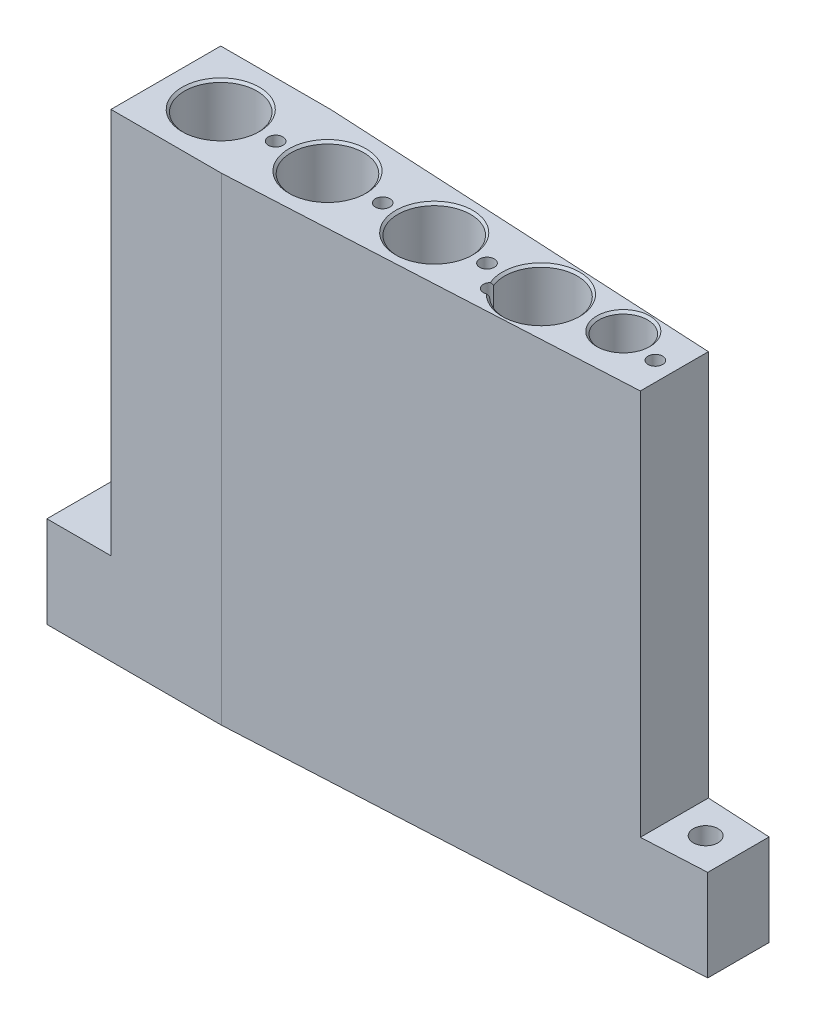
ISO-10303-21;
HEADER;
FILE_DESCRIPTION(('STEP AP214'),'2;1');
FILE_NAME('part.step','',(''),(''),'','','');
FILE_SCHEMA(('AUTOMOTIVE_DESIGN { 1 0 10303 214 1 1 1 1 }'));
ENDSEC;
DATA;
#1=APPLICATION_CONTEXT('core data for automotive mechanical design processes');
#2=APPLICATION_PROTOCOL_DEFINITION('international standard','automotive_design',2000,#1);
#3=PRODUCT_CONTEXT('',#1,'mechanical');
#4=PRODUCT('Part','Part','',(#3));
#5=PRODUCT_RELATED_PRODUCT_CATEGORY('part','',(#4));
#6=PRODUCT_DEFINITION_FORMATION('','',#4);
#7=PRODUCT_DEFINITION_CONTEXT('part definition',#1,'design');
#8=PRODUCT_DEFINITION('design','',#6,#7);
#9=PRODUCT_DEFINITION_SHAPE('','',#8);
#10=(LENGTH_UNIT() NAMED_UNIT(*) SI_UNIT(.MILLI.,.METRE.));
#11=(NAMED_UNIT(*) PLANE_ANGLE_UNIT() SI_UNIT($,.RADIAN.));
#12=(NAMED_UNIT(*) SI_UNIT($,.STERADIAN.) SOLID_ANGLE_UNIT());
#13=UNCERTAINTY_MEASURE_WITH_UNIT(LENGTH_MEASURE(1.E-05),#10,'distance_accuracy_value','');
#14=(GEOMETRIC_REPRESENTATION_CONTEXT(3) GLOBAL_UNCERTAINTY_ASSIGNED_CONTEXT((#13)) GLOBAL_UNIT_ASSIGNED_CONTEXT((#10,
#11,#12)) REPRESENTATION_CONTEXT('',''));
#15=CARTESIAN_POINT('',(0.,0.,0.));
#16=DIRECTION('',(0.,0.,1.));
#17=DIRECTION('',(1.,0.,0.));
#18=AXIS2_PLACEMENT_3D('',#15,#16,#17);
#19=CARTESIAN_POINT('',(69.58,52.25,-3.3534667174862));
#20=DIRECTION('',(-0.0523359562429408,0.,0.998629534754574));
#21=DIRECTION('',(0.998629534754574,0.,0.0523359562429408));
#22=AXIS2_PLACEMENT_3D('',#19,#20,#21);
#23=PLANE('',#22);
#24=DIRECTION('',(-0.998629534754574,0.,-0.0523359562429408));
#25=VECTOR('',#24,1.);
#26=CARTESIAN_POINT('',(69.58,0.,-3.3534667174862));
#27=LINE('',#26,#25);
#28=CARTESIAN_POINT('',(69.58,0.,-3.3534667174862));
#29=VERTEX_POINT('',#28);
#30=CARTESIAN_POINT('',(19.0811366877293,0.,-6.));
#31=VERTEX_POINT('',#30);
#32=EDGE_CURVE('E373',#29,#31,#27,.T.);
#33=ORIENTED_EDGE('',*,*,#32,.T.);
#34=DIRECTION('',(0.,-1.,0.));
#35=VECTOR('',#34,1.);
#36=CARTESIAN_POINT('',(19.0811366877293,52.25,-6.));
#37=LINE('',#36,#35);
#38=CARTESIAN_POINT('',(19.0811366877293,52.25,-6.));
#39=VERTEX_POINT('',#38);
#40=EDGE_CURVE('E343',#39,#31,#37,.T.);
#41=ORIENTED_EDGE('',*,*,#40,.F.);
#42=DIRECTION('',(-0.998629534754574,0.,-0.0523359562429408));
#43=VECTOR('',#42,1.);
#44=CARTESIAN_POINT('',(69.58,52.25,-3.3534667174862));
#45=LINE('',#44,#43);
#46=CARTESIAN_POINT('',(62.58,52.25,-3.72032117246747));
#47=VERTEX_POINT('',#46);
#48=EDGE_CURVE('E364',#47,#39,#45,.T.);
#49=ORIENTED_EDGE('',*,*,#48,.F.);
#50=DIRECTION('',(0.,1.,0.));
#51=VECTOR('',#50,1.);
#52=CARTESIAN_POINT('',(62.58,9.99999999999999,-3.72032117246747));
#53=LINE('',#52,#51);
#54=CARTESIAN_POINT('',(62.58,9.99999999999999,-3.72032117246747));
#55=VERTEX_POINT('',#54);
#56=EDGE_CURVE('E644',#55,#47,#53,.T.);
#57=ORIENTED_EDGE('',*,*,#56,.F.);
#58=DIRECTION('',(-0.998629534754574,0.,-0.0523359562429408));
#59=VECTOR('',#58,1.);
#60=CARTESIAN_POINT('',(69.58,9.99999999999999,-3.3534667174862));
#61=LINE('',#60,#59);
#62=CARTESIAN_POINT('',(69.58,9.99999999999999,-3.3534667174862));
#63=VERTEX_POINT('',#62);
#64=EDGE_CURVE('E650',#63,#55,#61,.T.);
#65=ORIENTED_EDGE('',*,*,#64,.F.);
#66=DIRECTION('',(0.,-1.,0.));
#67=VECTOR('',#66,1.);
#68=CARTESIAN_POINT('',(69.58,52.25,-3.3534667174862));
#69=LINE('',#68,#67);
#70=EDGE_CURVE('E363',#63,#29,#69,.T.);
#71=ORIENTED_EDGE('',*,*,#70,.T.);
#72=EDGE_LOOP('',(#33,#41,#49,#57,#65,#71));
#73=FACE_BOUND('',#72,.T.);
#74=ADVANCED_FACE('F221',(#73),#23,.F.);
#75=CARTESIAN_POINT('',(0.,52.25,7.));
#76=DIRECTION('',(-0.0523359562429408,0.,-0.998629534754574));
#77=DIRECTION('',(-0.998629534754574,0.,0.0523359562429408));
#78=AXIS2_PLACEMENT_3D('',#75,#76,#77);
#79=PLANE('',#78);
#80=DIRECTION('',(0.998629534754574,0.,-0.0523359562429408));
#81=VECTOR('',#80,1.);
#82=CARTESIAN_POINT('',(0.,52.25,7.));
#83=LINE('',#82,#81);
#84=CARTESIAN_POINT('',(19.0811366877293,52.25,6.));
#85=VERTEX_POINT('',#84);
#86=CARTESIAN_POINT('',(62.58,52.25,3.72032117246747));
#87=VERTEX_POINT('',#86);
#88=EDGE_CURVE('E350',#85,#87,#83,.T.);
#89=ORIENTED_EDGE('',*,*,#88,.F.);
#90=DIRECTION('',(0.,-1.,0.));
#91=VECTOR('',#90,1.);
#92=CARTESIAN_POINT('',(19.0811366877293,52.25,6.));
#93=LINE('',#92,#91);
#94=CARTESIAN_POINT('',(19.0811366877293,0.,6.));
#95=VERTEX_POINT('',#94);
#96=EDGE_CURVE('E332',#85,#95,#93,.T.);
#97=ORIENTED_EDGE('',*,*,#96,.T.);
#98=DIRECTION('',(0.998629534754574,0.,-0.0523359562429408));
#99=VECTOR('',#98,1.);
#100=CARTESIAN_POINT('',(0.,0.,7.));
#101=LINE('',#100,#99);
#102=CARTESIAN_POINT('',(69.58,0.,3.3534667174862));
#103=VERTEX_POINT('',#102);
#104=EDGE_CURVE('E380',#95,#103,#101,.T.);
#105=ORIENTED_EDGE('',*,*,#104,.T.);
#106=DIRECTION('',(0.,-1.,0.));
#107=VECTOR('',#106,1.);
#108=CARTESIAN_POINT('',(69.58,52.25,3.3534667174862));
#109=LINE('',#108,#107);
#110=CARTESIAN_POINT('',(69.58,9.99999999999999,3.3534667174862));
#111=VERTEX_POINT('',#110);
#112=EDGE_CURVE('E366',#111,#103,#109,.T.);
#113=ORIENTED_EDGE('',*,*,#112,.F.);
#114=DIRECTION('',(0.998629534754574,0.,-0.0523359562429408));
#115=VECTOR('',#114,1.);
#116=CARTESIAN_POINT('',(0.,9.99999999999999,7.));
#117=LINE('',#116,#115);
#118=CARTESIAN_POINT('',(62.58,9.99999999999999,3.72032117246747));
#119=VERTEX_POINT('',#118);
#120=EDGE_CURVE('E648',#119,#111,#117,.T.);
#121=ORIENTED_EDGE('',*,*,#120,.F.);
#122=DIRECTION('',(0.,1.,0.));
#123=VECTOR('',#122,1.);
#124=CARTESIAN_POINT('',(62.58,9.99999999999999,3.72032117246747));
#125=LINE('',#124,#123);
#126=EDGE_CURVE('E362',#119,#87,#125,.T.);
#127=ORIENTED_EDGE('',*,*,#126,.T.);
#128=EDGE_LOOP('',(#89,#97,#105,#113,#121,#127));
#129=FACE_BOUND('',#128,.T.);
#130=ADVANCED_FACE('F359',(#129),#79,.F.);
#131=CARTESIAN_POINT('',(0.,52.25,-7.));
#132=DIRECTION('',(0.,1.,0.));
#133=DIRECTION('',(0.,0.,1.));
#134=AXIS2_PLACEMENT_3D('',#131,#132,#133);
#135=PLANE('',#134);
#136=CARTESIAN_POINT('',(56.,52.25,-1.));
#137=DIRECTION('',(0.,1.,0.));
#138=DIRECTION('',(0.,0.,1.));
#139=AXIS2_PLACEMENT_3D('',#136,#137,#138);
#140=CIRCLE('',#139,2.90429999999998);
#141=CARTESIAN_POINT('',(56.,52.25,1.90429999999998));
#142=VERTEX_POINT('',#141);
#143=EDGE_CURVE('E597',#142,#142,#140,.F.);
#144=ORIENTED_EDGE('',*,*,#143,.T.);
#145=EDGE_LOOP('',(#144));
#146=FACE_BOUND('',#145,.T.);
#147=CARTESIAN_POINT('',(36.3333333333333,52.25,0.));
#148=DIRECTION('',(0.,1.,0.));
#149=DIRECTION('',(0.,0.,1.));
#150=AXIS2_PLACEMENT_3D('',#147,#148,#149);
#151=CIRCLE('',#150,4.21874999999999);
#152=CARTESIAN_POINT('',(36.3333333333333,52.25,4.21874999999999));
#153=VERTEX_POINT('',#152);
#154=EDGE_CURVE('E592',#153,#153,#151,.F.);
#155=ORIENTED_EDGE('',*,*,#154,.T.);
#156=EDGE_LOOP('',(#155));
#157=FACE_BOUND('',#156,.T.);
#158=CARTESIAN_POINT('',(24.6666666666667,52.25,0.));
#159=DIRECTION('',(0.,1.,0.));
#160=DIRECTION('',(0.,0.,1.));
#161=AXIS2_PLACEMENT_3D('',#158,#159,#160);
#162=CIRCLE('',#161,4.21874999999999);
#163=CARTESIAN_POINT('',(24.6666666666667,52.25,4.21874999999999));
#164=VERTEX_POINT('',#163);
#165=EDGE_CURVE('E589',#164,#164,#162,.F.);
#166=ORIENTED_EDGE('',*,*,#165,.T.);
#167=EDGE_LOOP('',(#166));
#168=FACE_BOUND('',#167,.T.);
#169=CARTESIAN_POINT('',(13.,52.25,0.));
#170=DIRECTION('',(0.,1.,0.));
#171=DIRECTION('',(0.,0.,1.));
#172=AXIS2_PLACEMENT_3D('',#169,#170,#171);
#173=CIRCLE('',#172,4.21874999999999);
#174=CARTESIAN_POINT('',(13.,52.25,4.21874999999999));
#175=VERTEX_POINT('',#174);
#176=EDGE_CURVE('E586',#175,#175,#173,.F.);
#177=ORIENTED_EDGE('',*,*,#176,.T.);
#178=EDGE_LOOP('',(#177));
#179=FACE_BOUND('',#178,.T.);
#180=DIRECTION('',(1.,0.,0.));
#181=VECTOR('',#180,1.);
#182=CARTESIAN_POINT('',(19.0811366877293,52.25,6.));
#183=LINE('',#182,#181);
#184=CARTESIAN_POINT('',(7.,52.25,6.));
#185=VERTEX_POINT('',#184);
#186=EDGE_CURVE('E335',#185,#85,#183,.T.);
#187=ORIENTED_EDGE('',*,*,#186,.T.);
#188=ORIENTED_EDGE('',*,*,#88,.T.);
#189=DIRECTION('',(0.,0.,-1.));
#190=VECTOR('',#189,1.);
#191=CARTESIAN_POINT('',(62.58,52.25,3.72032117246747));
#192=LINE('',#191,#190);
#193=EDGE_CURVE('E640',#87,#47,#192,.T.);
#194=ORIENTED_EDGE('',*,*,#193,.T.);
#195=ORIENTED_EDGE('',*,*,#48,.T.);
#196=DIRECTION('',(-1.,0.,0.));
#197=VECTOR('',#196,1.);
#198=CARTESIAN_POINT('',(0.,52.25,-6.));
#199=LINE('',#198,#197);
#200=CARTESIAN_POINT('',(7.,52.25,-6.));
#201=VERTEX_POINT('',#200);
#202=EDGE_CURVE('E355',#39,#201,#199,.T.);
#203=ORIENTED_EDGE('',*,*,#202,.T.);
#204=DIRECTION('',(0.,0.,1.));
#205=VECTOR('',#204,1.);
#206=CARTESIAN_POINT('',(7.,52.25,-7.));
#207=LINE('',#206,#205);
#208=EDGE_CURVE('E354',#201,#185,#207,.T.);
#209=ORIENTED_EDGE('',*,*,#208,.T.);
#210=EDGE_LOOP('',(#187,#188,#194,#195,#203,#209));
#211=FACE_BOUND('',#210,.T.);
#212=CARTESIAN_POINT('',(19.,52.25,0.));
#213=DIRECTION('',(0.,1.,0.));
#214=DIRECTION('',(0.,0.,1.));
#215=AXIS2_PLACEMENT_3D('',#212,#213,#214);
#216=CIRCLE('',#215,0.799999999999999);
#217=CARTESIAN_POINT('',(19.,52.25,0.799999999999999));
#218=VERTEX_POINT('',#217);
#219=EDGE_CURVE('E1098',#218,#218,#216,.T.);
#220=ORIENTED_EDGE('',*,*,#219,.F.);
#221=EDGE_LOOP('',(#220));
#222=FACE_BOUND('',#221,.T.);
#223=CARTESIAN_POINT('',(30.7,52.25,0.));
#224=DIRECTION('',(0.,1.,0.));
#225=DIRECTION('',(0.,0.,1.));
#226=AXIS2_PLACEMENT_3D('',#223,#224,#225);
#227=CIRCLE('',#226,0.800000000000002);
#228=CARTESIAN_POINT('',(30.7,52.25,0.800000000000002));
#229=VERTEX_POINT('',#228);
#230=EDGE_CURVE('E1104',#229,#229,#227,.T.);
#231=ORIENTED_EDGE('',*,*,#230,.F.);
#232=EDGE_LOOP('',(#231));
#233=FACE_BOUND('',#232,.T.);
#234=CARTESIAN_POINT('',(42.1,52.25,0.));
#235=DIRECTION('',(0.,1.,0.));
#236=DIRECTION('',(0.,0.,1.));
#237=AXIS2_PLACEMENT_3D('',#234,#235,#236);
#238=CIRCLE('',#237,0.800000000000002);
#239=CARTESIAN_POINT('',(42.1,52.25,0.800000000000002));
#240=VERTEX_POINT('',#239);
#241=EDGE_CURVE('E1110',#240,#240,#238,.T.);
#242=ORIENTED_EDGE('',*,*,#241,.F.);
#243=EDGE_LOOP('',(#242));
#244=FACE_BOUND('',#243,.T.);
#245=CARTESIAN_POINT('',(60.5,52.25,0.));
#246=DIRECTION('',(0.,1.,0.));
#247=DIRECTION('',(0.,0.,1.));
#248=AXIS2_PLACEMENT_3D('',#245,#246,#247);
#249=CIRCLE('',#248,0.800000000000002);
#250=CARTESIAN_POINT('',(60.5,52.25,0.800000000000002));
#251=VERTEX_POINT('',#250);
#252=EDGE_CURVE('E1116',#251,#251,#249,.T.);
#253=ORIENTED_EDGE('',*,*,#252,.F.);
#254=EDGE_LOOP('',(#253));
#255=FACE_BOUND('',#254,.T.);
#256=CARTESIAN_POINT('',(44.6968232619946,52.25,2.2));
#257=DIRECTION('',(0.,1.,0.));
#258=DIRECTION('',(0.,0.,1.));
#259=AXIS2_PLACEMENT_3D('',#256,#257,#258);
#260=CIRCLE('',#259,0.793749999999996);
#261=CARTESIAN_POINT('',(44.1195291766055,52.25,1.65523344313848));
#262=VERTEX_POINT('',#261);
#263=CARTESIAN_POINT('',(44.9769891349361,52.25,2.94266152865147));
#264=VERTEX_POINT('',#263);
#265=EDGE_CURVE('E611',#262,#264,#260,.T.);
#266=ORIENTED_EDGE('',*,*,#265,.F.);
#267=CARTESIAN_POINT('',(48.,52.25,0.));
#268=DIRECTION('',(0.,1.,0.));
#269=DIRECTION('',(0.,0.,1.));
#270=AXIS2_PLACEMENT_3D('',#267,#268,#269);
#271=CIRCLE('',#270,4.21875000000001);
#272=EDGE_CURVE('E595',#262,#264,#271,.F.);
#273=ORIENTED_EDGE('',*,*,#272,.T.);
#274=EDGE_LOOP('',(#266,#273));
#275=FACE_BOUND('',#274,.T.);
#276=ADVANCED_FACE('F347',(#146,#157,#168,#179,#211,#222,#233,#244,#255,#275),#135,.T.);
#277=CARTESIAN_POINT('',(69.58,52.25,3.3534667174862));
#278=DIRECTION('',(-1.,0.,0.));
#279=DIRECTION('',(0.,0.,1.));
#280=AXIS2_PLACEMENT_3D('',#277,#278,#279);
#281=PLANE('',#280);
#282=DIRECTION('',(0.,0.,-1.));
#283=VECTOR('',#282,1.);
#284=CARTESIAN_POINT('',(69.58,9.99999999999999,3.3534667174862));
#285=LINE('',#284,#283);
#286=EDGE_CURVE('E399',#111,#63,#285,.T.);
#287=ORIENTED_EDGE('',*,*,#286,.F.);
#288=ORIENTED_EDGE('',*,*,#112,.T.);
#289=DIRECTION('',(0.,0.,-1.));
#290=VECTOR('',#289,1.);
#291=CARTESIAN_POINT('',(69.58,0.,3.3534667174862));
#292=LINE('',#291,#290);
#293=EDGE_CURVE('E369',#103,#29,#292,.T.);
#294=ORIENTED_EDGE('',*,*,#293,.T.);
#295=ORIENTED_EDGE('',*,*,#70,.F.);
#296=EDGE_LOOP('',(#287,#288,#294,#295));
#297=FACE_BOUND('',#296,.T.);
#298=ADVANCED_FACE('F462',(#297),#281,.F.);
#299=CARTESIAN_POINT('',(36.3333333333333,0.,0.));
#300=DIRECTION('',(0.,-1.,0.));
#301=DIRECTION('',(0.,0.,-1.));
#302=AXIS2_PLACEMENT_3D('',#299,#300,#301);
#303=CYLINDRICAL_SURFACE('',#302,0.79374999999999);
#304=CARTESIAN_POINT('',(36.3333333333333,12.25,0.));
#305=DIRECTION('',(0.,-1.,0.));
#306=DIRECTION('',(0.,0.,-1.));
#307=AXIS2_PLACEMENT_3D('',#304,#305,#306);
#308=CIRCLE('',#307,0.79374999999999);
#309=CARTESIAN_POINT('',(36.3333333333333,12.25,-0.79374999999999));
#310=VERTEX_POINT('',#309);
#311=EDGE_CURVE('E392',#310,#310,#308,.T.);
#312=ORIENTED_EDGE('',*,*,#311,.F.);
#313=EDGE_LOOP('',(#312));
#314=FACE_BOUND('',#313,.T.);
#315=CARTESIAN_POINT('',(36.3333333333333,0.,0.));
#316=DIRECTION('',(0.,-1.,0.));
#317=DIRECTION('',(0.,0.,-1.));
#318=AXIS2_PLACEMENT_3D('',#315,#316,#317);
#319=CIRCLE('',#318,0.793749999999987);
#320=CARTESIAN_POINT('',(36.3333333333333,0.,-0.793749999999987));
#321=VERTEX_POINT('',#320);
#322=EDGE_CURVE('E395',#321,#321,#319,.T.);
#323=ORIENTED_EDGE('',*,*,#322,.T.);
#324=EDGE_LOOP('',(#323));
#325=FACE_BOUND('',#324,.T.);
#326=ADVANCED_FACE('F470',(#314,#325),#303,.F.);
#327=CARTESIAN_POINT('',(24.6666666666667,0.,0.));
#328=DIRECTION('',(0.,-1.,0.));
#329=DIRECTION('',(0.,0.,-1.));
#330=AXIS2_PLACEMENT_3D('',#327,#328,#329);
#331=CYLINDRICAL_SURFACE('',#330,0.79374999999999);
#332=CARTESIAN_POINT('',(24.6666666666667,12.25,0.));
#333=DIRECTION('',(0.,-1.,0.));
#334=DIRECTION('',(0.,0.,-1.));
#335=AXIS2_PLACEMENT_3D('',#332,#333,#334);
#336=CIRCLE('',#335,0.79374999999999);
#337=CARTESIAN_POINT('',(24.6666666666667,12.25,-0.79374999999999));
#338=VERTEX_POINT('',#337);
#339=EDGE_CURVE('E386',#338,#338,#336,.T.);
#340=ORIENTED_EDGE('',*,*,#339,.F.);
#341=EDGE_LOOP('',(#340));
#342=FACE_BOUND('',#341,.T.);
#343=CARTESIAN_POINT('',(24.6666666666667,0.,0.));
#344=DIRECTION('',(0.,-1.,0.));
#345=DIRECTION('',(0.,0.,-1.));
#346=AXIS2_PLACEMENT_3D('',#343,#344,#345);
#347=CIRCLE('',#346,0.793749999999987);
#348=CARTESIAN_POINT('',(24.6666666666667,0.,-0.793749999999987));
#349=VERTEX_POINT('',#348);
#350=EDGE_CURVE('E389',#349,#349,#347,.T.);
#351=ORIENTED_EDGE('',*,*,#350,.T.);
#352=EDGE_LOOP('',(#351));
#353=FACE_BOUND('',#352,.T.);
#354=ADVANCED_FACE('F476',(#342,#353),#331,.F.);
#355=CARTESIAN_POINT('',(0.,52.25,-7.));
#356=DIRECTION('',(1.,0.,0.));
#357=DIRECTION('',(0.,0.,-1.));
#358=AXIS2_PLACEMENT_3D('',#355,#356,#357);
#359=PLANE('',#358);
#360=DIRECTION('',(0.,0.,1.));
#361=VECTOR('',#360,1.);
#362=CARTESIAN_POINT('',(0.,0.,-7.));
#363=LINE('',#362,#361);
#364=CARTESIAN_POINT('',(0.,0.,-6.));
#365=VERTEX_POINT('',#364);
#366=CARTESIAN_POINT('',(0.,0.,6.));
#367=VERTEX_POINT('',#366);
#368=EDGE_CURVE('E376',#365,#367,#363,.T.);
#369=ORIENTED_EDGE('',*,*,#368,.T.);
#370=DIRECTION('',(0.,-1.,0.));
#371=VECTOR('',#370,1.);
#372=CARTESIAN_POINT('',(0.,52.25,6.));
#373=LINE('',#372,#371);
#374=CARTESIAN_POINT('',(0.,9.99999999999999,6.));
#375=VERTEX_POINT('',#374);
#376=EDGE_CURVE('E342',#375,#367,#373,.T.);
#377=ORIENTED_EDGE('',*,*,#376,.F.);
#378=DIRECTION('',(0.,0.,-1.));
#379=VECTOR('',#378,1.);
#380=CARTESIAN_POINT('',(0.,9.99999999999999,-7.));
#381=LINE('',#380,#379);
#382=CARTESIAN_POINT('',(0.,9.99999999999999,-6.));
#383=VERTEX_POINT('',#382);
#384=EDGE_CURVE('E653',#375,#383,#381,.T.);
#385=ORIENTED_EDGE('',*,*,#384,.T.);
#386=DIRECTION('',(0.,-1.,0.));
#387=VECTOR('',#386,1.);
#388=CARTESIAN_POINT('',(0.,52.25,-6.));
#389=LINE('',#388,#387);
#390=EDGE_CURVE('E569',#383,#365,#389,.T.);
#391=ORIENTED_EDGE('',*,*,#390,.T.);
#392=EDGE_LOOP('',(#369,#377,#385,#391));
#393=FACE_BOUND('',#392,.T.);
#394=ADVANCED_FACE('F466',(#393),#359,.F.);
#395=CARTESIAN_POINT('',(0.,0.,-7.));
#396=DIRECTION('',(0.,1.,0.));
#397=DIRECTION('',(0.,0.,1.));
#398=AXIS2_PLACEMENT_3D('',#395,#396,#397);
#399=PLANE('',#398);
#400=CARTESIAN_POINT('',(48.7,0.,0.));
#401=DIRECTION('',(0.,1.,0.));
#402=DIRECTION('',(0.,0.,1.));
#403=AXIS2_PLACEMENT_3D('',#400,#401,#402);
#404=CIRCLE('',#403,1.72699999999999);
#405=CARTESIAN_POINT('',(48.7,0.,1.72699999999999));
#406=VERTEX_POINT('',#405);
#407=EDGE_CURVE('E577',#406,#406,#404,.T.);
#408=ORIENTED_EDGE('',*,*,#407,.T.);
#409=EDGE_LOOP('',(#408));
#410=FACE_BOUND('',#409,.T.);
#411=CARTESIAN_POINT('',(8.,0.,0.));
#412=DIRECTION('',(0.,-1.,0.));
#413=DIRECTION('',(0.,0.,-1.));
#414=AXIS2_PLACEMENT_3D('',#411,#412,#413);
#415=CIRCLE('',#414,0.793749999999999);
#416=CARTESIAN_POINT('',(8.,0.,-0.793749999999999));
#417=VERTEX_POINT('',#416);
#418=EDGE_CURVE('E610',#417,#417,#415,.T.);
#419=ORIENTED_EDGE('',*,*,#418,.F.);
#420=EDGE_LOOP('',(#419));
#421=FACE_BOUND('',#420,.T.);
#422=CARTESIAN_POINT('',(62.,0.,0.));
#423=DIRECTION('',(0.,-1.,0.));
#424=DIRECTION('',(0.,0.,-1.));
#425=AXIS2_PLACEMENT_3D('',#422,#423,#424);
#426=CIRCLE('',#425,0.793749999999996);
#427=CARTESIAN_POINT('',(62.,0.,-0.793749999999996));
#428=VERTEX_POINT('',#427);
#429=EDGE_CURVE('E622',#428,#428,#426,.T.);
#430=ORIENTED_EDGE('',*,*,#429,.F.);
#431=EDGE_LOOP('',(#430));
#432=FACE_BOUND('',#431,.T.);
#433=CARTESIAN_POINT('',(3.5,0.,0.));
#434=DIRECTION('',(0.,1.,0.));
#435=DIRECTION('',(0.,0.,1.));
#436=AXIS2_PLACEMENT_3D('',#433,#434,#435);
#437=CIRCLE('',#436,1.34999999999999);
#438=CARTESIAN_POINT('',(3.5,0.,1.34999999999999));
#439=VERTEX_POINT('',#438);
#440=EDGE_CURVE('E631',#439,#439,#437,.T.);
#441=ORIENTED_EDGE('',*,*,#440,.T.);
#442=EDGE_LOOP('',(#441));
#443=FACE_BOUND('',#442,.T.);
#444=CARTESIAN_POINT('',(66.,0.,0.));
#445=DIRECTION('',(0.,1.,0.));
#446=DIRECTION('',(0.,0.,1.));
#447=AXIS2_PLACEMENT_3D('',#444,#445,#446);
#448=CIRCLE('',#447,1.34999999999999);
#449=CARTESIAN_POINT('',(66.,0.,1.34999999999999));
#450=VERTEX_POINT('',#449);
#451=EDGE_CURVE('E637',#450,#450,#448,.T.);
#452=ORIENTED_EDGE('',*,*,#451,.T.);
#453=EDGE_LOOP('',(#452));
#454=FACE_BOUND('',#453,.T.);
#455=CARTESIAN_POINT('',(56.,0.,-1.));
#456=DIRECTION('',(0.,1.,0.));
#457=DIRECTION('',(0.,0.,1.));
#458=AXIS2_PLACEMENT_3D('',#455,#456,#457);
#459=CIRCLE('',#458,2.65429999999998);
#460=CARTESIAN_POINT('',(56.,0.,1.65429999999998));
#461=VERTEX_POINT('',#460);
#462=EDGE_CURVE('E656',#461,#461,#459,.T.);
#463=ORIENTED_EDGE('',*,*,#462,.T.);
#464=EDGE_LOOP('',(#463));
#465=FACE_BOUND('',#464,.T.);
#466=ORIENTED_EDGE('',*,*,#322,.F.);
#467=EDGE_LOOP('',(#466));
#468=FACE_BOUND('',#467,.T.);
#469=ORIENTED_EDGE('',*,*,#350,.F.);
#470=EDGE_LOOP('',(#469));
#471=FACE_BOUND('',#470,.T.);
#472=CARTESIAN_POINT('',(13.,0.,0.));
#473=DIRECTION('',(0.,-1.,0.));
#474=DIRECTION('',(0.,0.,-1.));
#475=AXIS2_PLACEMENT_3D('',#472,#473,#474);
#476=CIRCLE('',#475,0.793749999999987);
#477=CARTESIAN_POINT('',(13.,0.,-0.793749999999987));
#478=VERTEX_POINT('',#477);
#479=EDGE_CURVE('E671',#478,#478,#476,.T.);
#480=ORIENTED_EDGE('',*,*,#479,.F.);
#481=EDGE_LOOP('',(#480));
#482=FACE_BOUND('',#481,.T.);
#483=ORIENTED_EDGE('',*,*,#104,.F.);
#484=DIRECTION('',(1.,0.,0.));
#485=VECTOR('',#484,1.);
#486=CARTESIAN_POINT('',(19.0811366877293,0.,6.));
#487=LINE('',#486,#485);
#488=EDGE_CURVE('E338',#367,#95,#487,.T.);
#489=ORIENTED_EDGE('',*,*,#488,.F.);
#490=ORIENTED_EDGE('',*,*,#368,.F.);
#491=DIRECTION('',(-1.,0.,0.));
#492=VECTOR('',#491,1.);
#493=CARTESIAN_POINT('',(0.,0.,-6.));
#494=LINE('',#493,#492);
#495=EDGE_CURVE('E356',#31,#365,#494,.T.);
#496=ORIENTED_EDGE('',*,*,#495,.F.);
#497=ORIENTED_EDGE('',*,*,#32,.F.);
#498=ORIENTED_EDGE('',*,*,#293,.F.);
#499=EDGE_LOOP('',(#483,#489,#490,#496,#497,#498));
#500=FACE_BOUND('',#499,.T.);
#501=ADVANCED_FACE('F458',(#410,#421,#432,#443,#454,#465,#468,#471,#482,#500),#399,.F.);
#502=CARTESIAN_POINT('',(13.,12.25,0.));
#503=DIRECTION('',(0.,-1.,0.));
#504=DIRECTION('',(0.,0.,-1.));
#505=AXIS2_PLACEMENT_3D('',#502,#503,#504);
#506=PLANE('',#505);
#507=CARTESIAN_POINT('',(13.,12.25,0.));
#508=DIRECTION('',(0.,-1.,0.));
#509=DIRECTION('',(0.,0.,-1.));
#510=AXIS2_PLACEMENT_3D('',#507,#508,#509);
#511=CIRCLE('',#510,0.79374999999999);
#512=CARTESIAN_POINT('',(13.,12.25,-0.79374999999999));
#513=VERTEX_POINT('',#512);
#514=EDGE_CURVE('E674',#513,#513,#511,.T.);
#515=ORIENTED_EDGE('',*,*,#514,.T.);
#516=EDGE_LOOP('',(#515));
#517=FACE_BOUND('',#516,.T.);
#518=CARTESIAN_POINT('',(13.,12.25,0.));
#519=DIRECTION('',(0.,1.,0.));
#520=DIRECTION('',(0.,0.,1.));
#521=AXIS2_PLACEMENT_3D('',#518,#519,#520);
#522=CIRCLE('',#521,3.96874999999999);
#523=CARTESIAN_POINT('',(13.,12.25,3.96874999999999));
#524=VERTEX_POINT('',#523);
#525=EDGE_CURVE('E377',#524,#524,#522,.T.);
#526=ORIENTED_EDGE('',*,*,#525,.T.);
#527=EDGE_LOOP('',(#526));
#528=FACE_BOUND('',#527,.T.);
#529=ADVANCED_FACE('F454',(#517,#528),#506,.F.);
#530=CARTESIAN_POINT('',(13.,52.25,0.));
#531=DIRECTION('',(0.,1.,0.));
#532=DIRECTION('',(0.,0.,1.));
#533=AXIS2_PLACEMENT_3D('',#530,#531,#532);
#534=CYLINDRICAL_SURFACE('',#533,3.96874999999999);
#535=CARTESIAN_POINT('',(13.,52.,0.));
#536=DIRECTION('',(0.,1.,0.));
#537=DIRECTION('',(0.,0.,1.));
#538=AXIS2_PLACEMENT_3D('',#535,#536,#537);
#539=CIRCLE('',#538,3.96874999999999);
#540=CARTESIAN_POINT('',(13.,52.,3.96874999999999));
#541=VERTEX_POINT('',#540);
#542=EDGE_CURVE('E15',#541,#541,#539,.T.);
#543=ORIENTED_EDGE('',*,*,#542,.T.);
#544=EDGE_LOOP('',(#543));
#545=FACE_BOUND('',#544,.T.);
#546=ORIENTED_EDGE('',*,*,#525,.F.);
#547=EDGE_LOOP('',(#546));
#548=FACE_BOUND('',#547,.T.);
#549=ADVANCED_FACE('F450',(#545,#548),#534,.F.);
#550=CARTESIAN_POINT('',(13.,0.,0.));
#551=DIRECTION('',(0.,-1.,0.));
#552=DIRECTION('',(0.,0.,-1.));
#553=AXIS2_PLACEMENT_3D('',#550,#551,#552);
#554=CYLINDRICAL_SURFACE('',#553,0.79374999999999);
#555=ORIENTED_EDGE('',*,*,#514,.F.);
#556=EDGE_LOOP('',(#555));
#557=FACE_BOUND('',#556,.T.);
#558=ORIENTED_EDGE('',*,*,#479,.T.);
#559=EDGE_LOOP('',(#558));
#560=FACE_BOUND('',#559,.T.);
#561=ADVANCED_FACE('F446',(#557,#560),#554,.F.);
#562=CARTESIAN_POINT('',(24.6666666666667,12.25,0.));
#563=DIRECTION('',(0.,-1.,0.));
#564=DIRECTION('',(0.,0.,-1.));
#565=AXIS2_PLACEMENT_3D('',#562,#563,#564);
#566=PLANE('',#565);
#567=ORIENTED_EDGE('',*,*,#339,.T.);
#568=EDGE_LOOP('',(#567));
#569=FACE_BOUND('',#568,.T.);
#570=CARTESIAN_POINT('',(24.6666666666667,12.25,0.));
#571=DIRECTION('',(0.,1.,0.));
#572=DIRECTION('',(0.,0.,1.));
#573=AXIS2_PLACEMENT_3D('',#570,#571,#572);
#574=CIRCLE('',#573,3.96874999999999);
#575=CARTESIAN_POINT('',(24.6666666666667,12.25,3.96874999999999));
#576=VERTEX_POINT('',#575);
#577=EDGE_CURVE('E668',#576,#576,#574,.T.);
#578=ORIENTED_EDGE('',*,*,#577,.T.);
#579=EDGE_LOOP('',(#578));
#580=FACE_BOUND('',#579,.T.);
#581=ADVANCED_FACE('F442',(#569,#580),#566,.F.);
#582=CARTESIAN_POINT('',(24.6666666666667,52.25,0.));
#583=DIRECTION('',(0.,1.,0.));
#584=DIRECTION('',(0.,0.,1.));
#585=AXIS2_PLACEMENT_3D('',#582,#583,#584);
#586=CYLINDRICAL_SURFACE('',#585,3.96874999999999);
#587=CARTESIAN_POINT('',(24.6666666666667,52.,0.));
#588=DIRECTION('',(0.,1.,0.));
#589=DIRECTION('',(0.,0.,1.));
#590=AXIS2_PLACEMENT_3D('',#587,#588,#589);
#591=CIRCLE('',#590,3.96874999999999);
#592=CARTESIAN_POINT('',(24.6666666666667,52.,3.96874999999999));
#593=VERTEX_POINT('',#592);
#594=EDGE_CURVE('E229',#593,#593,#591,.T.);
#595=ORIENTED_EDGE('',*,*,#594,.T.);
#596=EDGE_LOOP('',(#595));
#597=FACE_BOUND('',#596,.T.);
#598=ORIENTED_EDGE('',*,*,#577,.F.);
#599=EDGE_LOOP('',(#598));
#600=FACE_BOUND('',#599,.T.);
#601=ADVANCED_FACE('F438',(#597,#600),#586,.F.);
#602=CARTESIAN_POINT('',(36.3333333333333,12.25,0.));
#603=DIRECTION('',(0.,-1.,0.));
#604=DIRECTION('',(0.,0.,-1.));
#605=AXIS2_PLACEMENT_3D('',#602,#603,#604);
#606=PLANE('',#605);
#607=ORIENTED_EDGE('',*,*,#311,.T.);
#608=EDGE_LOOP('',(#607));
#609=FACE_BOUND('',#608,.T.);
#610=CARTESIAN_POINT('',(36.3333333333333,12.25,0.));
#611=DIRECTION('',(0.,1.,0.));
#612=DIRECTION('',(0.,0.,1.));
#613=AXIS2_PLACEMENT_3D('',#610,#611,#612);
#614=CIRCLE('',#613,3.96874999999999);
#615=CARTESIAN_POINT('',(36.3333333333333,12.25,3.96874999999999));
#616=VERTEX_POINT('',#615);
#617=EDGE_CURVE('E665',#616,#616,#614,.T.);
#618=ORIENTED_EDGE('',*,*,#617,.T.);
#619=EDGE_LOOP('',(#618));
#620=FACE_BOUND('',#619,.T.);
#621=ADVANCED_FACE('F434',(#609,#620),#606,.F.);
#622=CARTESIAN_POINT('',(36.3333333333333,52.25,0.));
#623=DIRECTION('',(0.,1.,0.));
#624=DIRECTION('',(0.,0.,1.));
#625=AXIS2_PLACEMENT_3D('',#622,#623,#624);
#626=CYLINDRICAL_SURFACE('',#625,3.96874999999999);
#627=CARTESIAN_POINT('',(36.3333333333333,52.,0.));
#628=DIRECTION('',(0.,1.,0.));
#629=DIRECTION('',(0.,0.,1.));
#630=AXIS2_PLACEMENT_3D('',#627,#628,#629);
#631=CIRCLE('',#630,3.96874999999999);
#632=CARTESIAN_POINT('',(36.3333333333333,52.,3.96874999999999));
#633=VERTEX_POINT('',#632);
#634=EDGE_CURVE('E511',#633,#633,#631,.T.);
#635=ORIENTED_EDGE('',*,*,#634,.T.);
#636=EDGE_LOOP('',(#635));
#637=FACE_BOUND('',#636,.T.);
#638=ORIENTED_EDGE('',*,*,#617,.F.);
#639=EDGE_LOOP('',(#638));
#640=FACE_BOUND('',#639,.T.);
#641=ADVANCED_FACE('F430',(#637,#640),#626,.F.);
#642=CARTESIAN_POINT('',(48.,12.25,0.));
#643=DIRECTION('',(0.,-1.,0.));
#644=DIRECTION('',(0.,0.,-1.));
#645=AXIS2_PLACEMENT_3D('',#642,#643,#644);
#646=PLANE('',#645);
#647=CARTESIAN_POINT('',(48.7,12.25,0.));
#648=DIRECTION('',(0.,-1.,0.));
#649=DIRECTION('',(0.,0.,-1.));
#650=AXIS2_PLACEMENT_3D('',#647,#648,#649);
#651=CIRCLE('',#650,0.793749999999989);
#652=CARTESIAN_POINT('',(48.7,12.25,-0.793749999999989));
#653=VERTEX_POINT('',#652);
#654=EDGE_CURVE('E659',#653,#653,#651,.T.);
#655=ORIENTED_EDGE('',*,*,#654,.T.);
#656=EDGE_LOOP('',(#655));
#657=FACE_BOUND('',#656,.T.);
#658=CARTESIAN_POINT('',(48.,12.25,0.));
#659=DIRECTION('',(0.,1.,0.));
#660=DIRECTION('',(0.,0.,1.));
#661=AXIS2_PLACEMENT_3D('',#658,#659,#660);
#662=CIRCLE('',#661,3.96874999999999);
#663=CARTESIAN_POINT('',(48.,12.25,3.96874999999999));
#664=VERTEX_POINT('',#663);
#665=EDGE_CURVE('E662',#664,#664,#662,.T.);
#666=ORIENTED_EDGE('',*,*,#665,.T.);
#667=EDGE_LOOP('',(#666));
#668=FACE_BOUND('',#667,.T.);
#669=ADVANCED_FACE('F424',(#657,#668),#646,.F.);
#670=CARTESIAN_POINT('',(48.,52.25,0.));
#671=DIRECTION('',(0.,1.,0.));
#672=DIRECTION('',(0.,0.,1.));
#673=AXIS2_PLACEMENT_3D('',#670,#671,#672);
#674=CYLINDRICAL_SURFACE('',#673,3.96874999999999);
#675=ORIENTED_EDGE('',*,*,#665,.F.);
#676=EDGE_LOOP('',(#675));
#677=FACE_BOUND('',#676,.T.);
#678=DIRECTION('',(0.,1.,0.));
#679=VECTOR('',#678,1.);
#680=CARTESIAN_POINT('',(45.2006812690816,49.25,2.81332387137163));
#681=LINE('',#680,#679);
#682=CARTESIAN_POINT('',(45.2006812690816,46.25,2.81332387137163));
#683=VERTEX_POINT('',#682);
#684=CARTESIAN_POINT('',(45.2006812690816,52.,2.81332387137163));
#685=VERTEX_POINT('',#684);
#686=EDGE_CURVE('E566',#683,#685,#681,.T.);
#687=ORIENTED_EDGE('',*,*,#686,.T.);
#688=CARTESIAN_POINT('',(48.,52.,0.));
#689=DIRECTION('',(0.,1.,0.));
#690=DIRECTION('',(0.,0.,1.));
#691=AXIS2_PLACEMENT_3D('',#688,#689,#690);
#692=CIRCLE('',#691,3.96874999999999);
#693=CARTESIAN_POINT('',(44.3250923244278,52.,1.49867612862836));
#694=VERTEX_POINT('',#693);
#695=EDGE_CURVE('E599',#685,#694,#692,.T.);
#696=ORIENTED_EDGE('',*,*,#695,.T.);
#697=DIRECTION('',(0.,1.,0.));
#698=VECTOR('',#697,1.);
#699=CARTESIAN_POINT('',(44.3250923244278,49.25,1.49867612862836));
#700=LINE('',#699,#698);
#701=CARTESIAN_POINT('',(44.3250923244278,46.25,1.49867612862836));
#702=VERTEX_POINT('',#701);
#703=EDGE_CURVE('E602',#694,#702,#700,.F.);
#704=ORIENTED_EDGE('',*,*,#703,.T.);
#705=CARTESIAN_POINT('',(44.6968232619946,45.7730668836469,2.2));
#706=CARTESIAN_POINT('',(44.6968197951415,45.7730706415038,2.19999479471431));
#707=CARTESIAN_POINT('',(44.6968163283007,45.7730743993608,2.19998958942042));
#708=CARTESIAN_POINT('',(44.6967811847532,45.7731124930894,2.19993682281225));
#709=CARTESIAN_POINT('',(44.6967495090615,45.773146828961,2.19988926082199));
#710=CARTESIAN_POINT('',(44.6965911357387,45.7733185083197,2.19965144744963));
#711=CARTESIAN_POINT('',(44.6964644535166,45.773455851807,2.1994611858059));
#712=CARTESIAN_POINT('',(44.6958311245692,45.774142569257,2.19850982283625));
#713=CARTESIAN_POINT('',(44.6953247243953,45.7746919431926,2.19774855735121));
#714=CARTESIAN_POINT('',(44.6927940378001,45.777438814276,2.19394135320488));
#715=CARTESIAN_POINT('',(44.6907736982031,45.7796363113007,2.19089279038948));
#716=CARTESIAN_POINT('',(44.6806929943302,45.7906238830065,2.17563590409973));
#717=CARTESIAN_POINT('',(44.6726958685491,45.7994139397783,2.1633857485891));
#718=CARTESIAN_POINT('',(44.6330444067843,45.8433697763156,2.1019066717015));
#719=CARTESIAN_POINT('',(44.6024089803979,45.8785344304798,2.05201748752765));
#720=CARTESIAN_POINT('',(44.4544713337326,46.0547175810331,1.79870747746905));
#721=CARTESIAN_POINT('',(44.3539521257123,46.1956633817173,1.58529261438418));
#722=CARTESIAN_POINT('',(44.2729780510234,46.3362982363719,1.36392226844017));
#723=B_SPLINE_CURVE_WITH_KNOTS('',3,(#705,#706,#707,#708,#709,#710,#711,#712,#713,#714,#715,
#716,#717,#718,#719,#720,#721,#722),.UNSPECIFIED.,.F.,.F.,(4,2,2,2,2,2,2,2,4),(0.,
2.1888810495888E-05,0.000221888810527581,0.00102188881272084,0.00422188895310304,
0.017021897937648,0.0682224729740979,0.273059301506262,1.09464358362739),.UNSPECIFIED.);
#724=CARTESIAN_POINT('',(44.6968232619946,45.7730668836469,2.2));
#725=VERTEX_POINT('',#724);
#726=EDGE_CURVE('E401',#702,#725,#723,.F.);
#727=ORIENTED_EDGE('',*,*,#726,.T.);
#728=CARTESIAN_POINT('',(44.6968232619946,45.7730668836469,2.2));
#729=CARTESIAN_POINT('',(44.6968267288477,45.7730706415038,2.20000520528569));
#730=CARTESIAN_POINT('',(44.6968301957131,45.7730743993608,2.20001041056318));
#731=CARTESIAN_POINT('',(44.6968653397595,45.7731124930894,2.20006317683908));
#732=CARTESIAN_POINT('',(44.6968970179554,45.773146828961,2.20011073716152));
#733=CARTESIAN_POINT('',(44.6970554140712,45.7733185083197,2.20034853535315));
#734=CARTESIAN_POINT('',(44.697182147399,45.773455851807,2.20053876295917));
#735=CARTESIAN_POINT('',(44.6978158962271,45.774142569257,2.20148984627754));
#736=CARTESIAN_POINT('',(44.6983231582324,45.7746919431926,2.20225053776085));
#737=CARTESIAN_POINT('',(44.7008607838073,45.777438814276,2.20605312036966));
#738=CARTESIAN_POINT('',(44.7028950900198,45.7796363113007,2.2090923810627));
#739=CARTESIAN_POINT('',(44.7130876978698,45.7906238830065,2.22427473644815));
#740=CARTESIAN_POINT('',(44.7213089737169,45.7994139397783,2.23637560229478));
#741=CARTESIAN_POINT('',(44.7627548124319,45.8433697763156,2.29665957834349));
#742=CARTESIAN_POINT('',(44.796981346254,45.8785344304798,2.34415699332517));
#743=CARTESIAN_POINT('',(44.9736990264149,46.0547175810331,2.5782987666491));
#744=CARTESIAN_POINT('',(45.1318807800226,46.1956633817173,2.75330890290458));
#745=CARTESIAN_POINT('',(45.3049367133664,46.3362982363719,2.91335038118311));
#746=B_SPLINE_CURVE_WITH_KNOTS('',3,(#728,#729,#730,#731,#732,#733,#734,#735,#736,#737,#738,
#739,#740,#741,#742,#743,#744,#745),.UNSPECIFIED.,.F.,.F.,(4,2,2,2,2,2,2,2,4),(0.,
2.18888104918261E-05,0.000221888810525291,0.00102188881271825,0.00422188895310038,
0.0170218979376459,0.0682224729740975,0.273059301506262,1.09464358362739),.UNSPECIFIED.);
#747=EDGE_CURVE('E409',#725,#683,#746,.T.);
#748=ORIENTED_EDGE('',*,*,#747,.T.);
#749=EDGE_LOOP('',(#687,#696,#704,#727,#748));
#750=FACE_BOUND('',#749,.T.);
#751=ADVANCED_FACE('F418',(#677,#750),#674,.F.);
#752=CARTESIAN_POINT('',(48.7,0.,0.));
#753=DIRECTION('',(0.,-1.,0.));
#754=DIRECTION('',(0.,0.,-1.));
#755=AXIS2_PLACEMENT_3D('',#752,#753,#754);
#756=CYLINDRICAL_SURFACE('',#755,0.793749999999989);
#757=CARTESIAN_POINT('',(48.7,0.538812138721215,0.));
#758=DIRECTION('',(0.,1.,0.));
#759=DIRECTION('',(0.,0.,1.));
#760=AXIS2_PLACEMENT_3D('',#757,#758,#759);
#761=CIRCLE('',#760,0.793749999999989);
#762=CARTESIAN_POINT('',(48.7,0.538812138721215,0.793749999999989));
#763=VERTEX_POINT('',#762);
#764=EDGE_CURVE('E574',#763,#763,#761,.F.);
#765=ORIENTED_EDGE('',*,*,#764,.T.);
#766=EDGE_LOOP('',(#765));
#767=FACE_BOUND('',#766,.T.);
#768=ORIENTED_EDGE('',*,*,#654,.F.);
#769=EDGE_LOOP('',(#768));
#770=FACE_BOUND('',#769,.T.);
#771=ADVANCED_FACE('F423',(#767,#770),#756,.F.);
#772=CARTESIAN_POINT('',(56.,52.25,-1.));
#773=DIRECTION('',(0.,1.,0.));
#774=DIRECTION('',(0.,0.,1.));
#775=AXIS2_PLACEMENT_3D('',#772,#773,#774);
#776=CYLINDRICAL_SURFACE('',#775,2.65429999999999);
#777=CARTESIAN_POINT('',(56.,52.,-1.));
#778=DIRECTION('',(0.,1.,0.));
#779=DIRECTION('',(0.,0.,1.));
#780=AXIS2_PLACEMENT_3D('',#777,#778,#779);
#781=CIRCLE('',#780,2.65429999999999);
#782=CARTESIAN_POINT('',(56.,52.,1.65429999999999));
#783=VERTEX_POINT('',#782);
#784=EDGE_CURVE('E583',#783,#783,#781,.T.);
#785=ORIENTED_EDGE('',*,*,#784,.T.);
#786=EDGE_LOOP('',(#785));
#787=FACE_BOUND('',#786,.T.);
#788=ORIENTED_EDGE('',*,*,#462,.F.);
#789=EDGE_LOOP('',(#788));
#790=FACE_BOUND('',#789,.T.);
#791=ADVANCED_FACE('F713',(#787,#790),#776,.F.);
#792=CARTESIAN_POINT('',(7.,9.99999999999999,-7.));
#793=DIRECTION('',(0.,-1.,0.));
#794=DIRECTION('',(0.,0.,-1.));
#795=AXIS2_PLACEMENT_3D('',#792,#793,#794);
#796=PLANE('',#795);
#797=CARTESIAN_POINT('',(3.5,9.99999999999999,0.));
#798=DIRECTION('',(0.,1.,0.));
#799=DIRECTION('',(0.,0.,1.));
#800=AXIS2_PLACEMENT_3D('',#797,#798,#799);
#801=CIRCLE('',#800,1.35);
#802=CARTESIAN_POINT('',(3.5,9.99999999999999,1.35));
#803=VERTEX_POINT('',#802);
#804=EDGE_CURVE('E628',#803,#803,#801,.T.);
#805=ORIENTED_EDGE('',*,*,#804,.F.);
#806=EDGE_LOOP('',(#805));
#807=FACE_BOUND('',#806,.T.);
#808=ORIENTED_EDGE('',*,*,#384,.F.);
#809=DIRECTION('',(1.,0.,0.));
#810=VECTOR('',#809,1.);
#811=CARTESIAN_POINT('',(7.,9.99999999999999,6.));
#812=LINE('',#811,#810);
#813=CARTESIAN_POINT('',(7.,9.99999999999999,6.));
#814=VERTEX_POINT('',#813);
#815=EDGE_CURVE('E1090',#375,#814,#812,.T.);
#816=ORIENTED_EDGE('',*,*,#815,.T.);
#817=DIRECTION('',(0.,0.,1.));
#818=VECTOR('',#817,1.);
#819=CARTESIAN_POINT('',(7.,9.99999999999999,-7.));
#820=LINE('',#819,#818);
#821=CARTESIAN_POINT('',(7.,9.99999999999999,-6.));
#822=VERTEX_POINT('',#821);
#823=EDGE_CURVE('E572',#822,#814,#820,.T.);
#824=ORIENTED_EDGE('',*,*,#823,.F.);
#825=DIRECTION('',(-1.,0.,0.));
#826=VECTOR('',#825,1.);
#827=CARTESIAN_POINT('',(7.,9.99999999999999,-6.));
#828=LINE('',#827,#826);
#829=EDGE_CURVE('E561',#822,#383,#828,.T.);
#830=ORIENTED_EDGE('',*,*,#829,.T.);
#831=EDGE_LOOP('',(#808,#816,#824,#830));
#832=FACE_BOUND('',#831,.T.);
#833=ADVANCED_FACE('F710',(#807,#832),#796,.F.);
#834=CARTESIAN_POINT('',(7.,9.99999999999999,-7.));
#835=DIRECTION('',(-1.,0.,0.));
#836=DIRECTION('',(0.,0.,1.));
#837=AXIS2_PLACEMENT_3D('',#834,#835,#836);
#838=PLANE('',#837);
#839=DIRECTION('',(0.,-1.,0.));
#840=VECTOR('',#839,1.);
#841=CARTESIAN_POINT('',(7.,9.99999999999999,6.));
#842=LINE('',#841,#840);
#843=EDGE_CURVE('E565',#185,#814,#842,.T.);
#844=ORIENTED_EDGE('',*,*,#843,.F.);
#845=ORIENTED_EDGE('',*,*,#208,.F.);
#846=DIRECTION('',(0.,1.,0.));
#847=VECTOR('',#846,1.);
#848=CARTESIAN_POINT('',(7.,9.99999999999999,-6.));
#849=LINE('',#848,#847);
#850=EDGE_CURVE('E558',#822,#201,#849,.T.);
#851=ORIENTED_EDGE('',*,*,#850,.F.);
#852=ORIENTED_EDGE('',*,*,#823,.T.);
#853=EDGE_LOOP('',(#844,#845,#851,#852));
#854=FACE_BOUND('',#853,.T.);
#855=ADVANCED_FACE('F571',(#854),#838,.T.);
#856=CARTESIAN_POINT('',(69.58,9.99999999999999,3.72032117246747));
#857=DIRECTION('',(0.,1.,0.));
#858=DIRECTION('',(0.,0.,1.));
#859=AXIS2_PLACEMENT_3D('',#856,#857,#858);
#860=PLANE('',#859);
#861=CARTESIAN_POINT('',(66.,9.99999999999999,0.));
#862=DIRECTION('',(0.,1.,0.));
#863=DIRECTION('',(0.,0.,1.));
#864=AXIS2_PLACEMENT_3D('',#861,#862,#863);
#865=CIRCLE('',#864,1.35);
#866=CARTESIAN_POINT('',(66.,9.99999999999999,1.35));
#867=VERTEX_POINT('',#866);
#868=EDGE_CURVE('E634',#867,#867,#865,.T.);
#869=ORIENTED_EDGE('',*,*,#868,.F.);
#870=EDGE_LOOP('',(#869));
#871=FACE_BOUND('',#870,.T.);
#872=ORIENTED_EDGE('',*,*,#64,.T.);
#873=DIRECTION('',(0.,0.,-1.));
#874=VECTOR('',#873,1.);
#875=CARTESIAN_POINT('',(62.58,9.99999999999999,3.72032117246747));
#876=LINE('',#875,#874);
#877=EDGE_CURVE('E641',#119,#55,#876,.T.);
#878=ORIENTED_EDGE('',*,*,#877,.F.);
#879=ORIENTED_EDGE('',*,*,#120,.T.);
#880=ORIENTED_EDGE('',*,*,#286,.T.);
#881=EDGE_LOOP('',(#872,#878,#879,#880));
#882=FACE_BOUND('',#881,.T.);
#883=ADVANCED_FACE('F693',(#871,#882),#860,.T.);
#884=CARTESIAN_POINT('',(62.58,9.99999999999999,3.72032117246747));
#885=DIRECTION('',(1.,0.,0.));
#886=DIRECTION('',(0.,0.,-1.));
#887=AXIS2_PLACEMENT_3D('',#884,#885,#886);
#888=PLANE('',#887);
#889=ORIENTED_EDGE('',*,*,#193,.F.);
#890=ORIENTED_EDGE('',*,*,#126,.F.);
#891=ORIENTED_EDGE('',*,*,#877,.T.);
#892=ORIENTED_EDGE('',*,*,#56,.T.);
#893=EDGE_LOOP('',(#889,#890,#891,#892));
#894=FACE_BOUND('',#893,.T.);
#895=ADVANCED_FACE('F696',(#894),#888,.T.);
#896=CARTESIAN_POINT('',(66.,9.99999999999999,0.));
#897=DIRECTION('',(0.,1.,0.));
#898=DIRECTION('',(0.,0.,1.));
#899=AXIS2_PLACEMENT_3D('',#896,#897,#898);
#900=CYLINDRICAL_SURFACE('',#899,1.35);
#901=ORIENTED_EDGE('',*,*,#451,.F.);
#902=EDGE_LOOP('',(#901));
#903=FACE_BOUND('',#902,.T.);
#904=ORIENTED_EDGE('',*,*,#868,.T.);
#905=EDGE_LOOP('',(#904));
#906=FACE_BOUND('',#905,.T.);
#907=ADVANCED_FACE('F698',(#903,#906),#900,.F.);
#908=CARTESIAN_POINT('',(3.5,9.99999999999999,0.));
#909=DIRECTION('',(0.,1.,0.));
#910=DIRECTION('',(0.,0.,1.));
#911=AXIS2_PLACEMENT_3D('',#908,#909,#910);
#912=CYLINDRICAL_SURFACE('',#911,1.35);
#913=ORIENTED_EDGE('',*,*,#440,.F.);
#914=EDGE_LOOP('',(#913));
#915=FACE_BOUND('',#914,.T.);
#916=ORIENTED_EDGE('',*,*,#804,.T.);
#917=EDGE_LOOP('',(#916));
#918=FACE_BOUND('',#917,.T.);
#919=ADVANCED_FACE('F704',(#915,#918),#912,.F.);
#920=CARTESIAN_POINT('',(62.,5.,0.));
#921=DIRECTION('',(0.,1.,0.));
#922=DIRECTION('',(0.,0.,1.));
#923=AXIS2_PLACEMENT_3D('',#920,#921,#922);
#924=PLANE('',#923);
#925=CARTESIAN_POINT('',(62.,5.,0.));
#926=DIRECTION('',(0.,-1.,0.));
#927=DIRECTION('',(0.,0.,-1.));
#928=AXIS2_PLACEMENT_3D('',#925,#926,#927);
#929=CIRCLE('',#928,0.793749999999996);
#930=CARTESIAN_POINT('',(62.,5.,-0.793749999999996));
#931=VERTEX_POINT('',#930);
#932=EDGE_CURVE('E625',#931,#931,#929,.T.);
#933=ORIENTED_EDGE('',*,*,#932,.T.);
#934=EDGE_LOOP('',(#933));
#935=FACE_BOUND('',#934,.T.);
#936=ADVANCED_FACE('F782',(#935),#924,.F.);
#937=CARTESIAN_POINT('',(62.,0.,0.));
#938=DIRECTION('',(0.,-1.,0.));
#939=DIRECTION('',(0.,0.,-1.));
#940=AXIS2_PLACEMENT_3D('',#937,#938,#939);
#941=CYLINDRICAL_SURFACE('',#940,0.793749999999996);
#942=ORIENTED_EDGE('',*,*,#932,.F.);
#943=EDGE_LOOP('',(#942));
#944=FACE_BOUND('',#943,.T.);
#945=ORIENTED_EDGE('',*,*,#429,.T.);
#946=EDGE_LOOP('',(#945));
#947=FACE_BOUND('',#946,.T.);
#948=ADVANCED_FACE('F792',(#944,#947),#941,.F.);
#949=CARTESIAN_POINT('',(8.,5.,0.));
#950=DIRECTION('',(0.,1.,0.));
#951=DIRECTION('',(0.,0.,1.));
#952=AXIS2_PLACEMENT_3D('',#949,#950,#951);
#953=PLANE('',#952);
#954=CARTESIAN_POINT('',(8.,5.,0.));
#955=DIRECTION('',(0.,-1.,0.));
#956=DIRECTION('',(0.,0.,-1.));
#957=AXIS2_PLACEMENT_3D('',#954,#955,#956);
#958=CIRCLE('',#957,0.793749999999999);
#959=CARTESIAN_POINT('',(8.,5.,-0.793749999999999));
#960=VERTEX_POINT('',#959);
#961=EDGE_CURVE('E614',#960,#960,#958,.T.);
#962=ORIENTED_EDGE('',*,*,#961,.T.);
#963=EDGE_LOOP('',(#962));
#964=FACE_BOUND('',#963,.T.);
#965=ADVANCED_FACE('F802',(#964),#953,.F.);
#966=CARTESIAN_POINT('',(8.,0.,0.));
#967=DIRECTION('',(0.,-1.,0.));
#968=DIRECTION('',(0.,0.,-1.));
#969=AXIS2_PLACEMENT_3D('',#966,#967,#968);
#970=CYLINDRICAL_SURFACE('',#969,0.793749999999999);
#971=ORIENTED_EDGE('',*,*,#961,.F.);
#972=EDGE_LOOP('',(#971));
#973=FACE_BOUND('',#972,.T.);
#974=ORIENTED_EDGE('',*,*,#418,.T.);
#975=EDGE_LOOP('',(#974));
#976=FACE_BOUND('',#975,.T.);
#977=ADVANCED_FACE('F516',(#973,#976),#970,.F.);
#978=CARTESIAN_POINT('',(44.6968232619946,52.25,2.2));
#979=DIRECTION('',(0.,1.,0.));
#980=DIRECTION('',(0.,0.,1.));
#981=AXIS2_PLACEMENT_3D('',#978,#979,#980);
#982=CYLINDRICAL_SURFACE('',#981,0.793749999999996);
#983=ORIENTED_EDGE('',*,*,#703,.F.);
#984=CARTESIAN_POINT('',(44.3250923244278,52.,1.49867612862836));
#985=CARTESIAN_POINT('',(44.3062506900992,52.0212195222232,1.50866473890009));
#986=CARTESIAN_POINT('',(44.2877709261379,52.0423972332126,1.51943080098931));
#987=CARTESIAN_POINT('',(44.2516859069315,52.0845262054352,1.54246747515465));
#988=CARTESIAN_POINT('',(44.234077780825,52.1054780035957,1.55473261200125));
#989=CARTESIAN_POINT('',(44.199750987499,52.147164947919,1.5807887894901));
#990=CARTESIAN_POINT('',(44.1830323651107,52.1679000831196,1.5945799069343));
#991=CARTESIAN_POINT('',(44.1505319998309,52.2091521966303,1.62373398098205));
#992=CARTESIAN_POINT('',(44.1347538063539,52.2296681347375,1.63910236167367));
#993=CARTESIAN_POINT('',(44.1195291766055,52.25,1.65523344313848));
#994=B_SPLINE_CURVE_WITH_KNOTS('',3,(#984,#985,#986,#987,#988,#989,#990,#991,#992,#993),
.UNSPECIFIED.,.F.,.F.,(4,2,2,2,4),(0.,0.090242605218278,0.180164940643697,0.270091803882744,
0.360338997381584),.UNSPECIFIED.);
#995=EDGE_CURVE('E236',#694,#262,#994,.T.);
#996=ORIENTED_EDGE('',*,*,#995,.T.);
#997=ORIENTED_EDGE('',*,*,#265,.T.);
#998=CARTESIAN_POINT('',(44.9769891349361,52.25,2.94266152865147));
#999=CARTESIAN_POINT('',(44.9977419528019,52.2296681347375,2.93483071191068));
#1000=CARTESIAN_POINT('',(45.0180043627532,52.2091521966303,2.92619513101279));
#1001=CARTESIAN_POINT('',(45.0574326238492,52.1679000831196,2.9074429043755));
#1002=CARTESIAN_POINT('',(45.0766021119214,52.147164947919,2.89733162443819));
#1003=CARTESIAN_POINT('',(45.1138758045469,52.1054780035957,2.87570005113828));
#1004=CARTESIAN_POINT('',(45.1319800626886,52.0845262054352,2.86417982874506));
#1005=CARTESIAN_POINT('',(45.1671452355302,52.0423972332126,2.83976205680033));
#1006=CARTESIAN_POINT('',(45.1842022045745,52.0212195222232,2.82685974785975));
#1007=CARTESIAN_POINT('',(45.2006812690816,52.,2.81332387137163));
#1008=B_SPLINE_CURVE_WITH_KNOTS('',3,(#998,#999,#1000,#1001,#1002,#1003,#1004,#1005,#1006,
#1007),.UNSPECIFIED.,.F.,.F.,(4,2,2,2,4),(0.,0.0902471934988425,0.180174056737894,
0.270096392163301,0.360338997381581),.UNSPECIFIED.);
#1009=EDGE_CURVE('E244',#264,#685,#1008,.T.);
#1010=ORIENTED_EDGE('',*,*,#1009,.T.);
#1011=ORIENTED_EDGE('',*,*,#686,.F.);
#1012=CARTESIAN_POINT('',(44.6968232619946,46.25,2.2));
#1013=DIRECTION('',(0.,1.,0.));
#1014=DIRECTION('',(0.,0.,1.));
#1015=AXIS2_PLACEMENT_3D('',#1012,#1013,#1014);
#1016=CIRCLE('',#1015,0.793749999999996);
#1017=EDGE_CURVE('E608',#702,#683,#1016,.T.);
#1018=ORIENTED_EDGE('',*,*,#1017,.F.);
#1019=EDGE_LOOP('',(#983,#996,#997,#1010,#1011,#1018));
#1020=FACE_BOUND('',#1019,.T.);
#1021=ADVANCED_FACE('F512',(#1020),#982,.F.);
#1022=CARTESIAN_POINT('',(44.6968232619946,46.25,2.2));
#1023=DIRECTION('',(0.,1.,0.));
#1024=DIRECTION('',(0.,0.,1.));
#1025=AXIS2_PLACEMENT_3D('',#1022,#1023,#1024);
#1026=CONICAL_SURFACE('',#1025,0.793749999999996,1.02974425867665);
#1027=ORIENTED_EDGE('',*,*,#726,.F.);
#1028=ORIENTED_EDGE('',*,*,#1017,.T.);
#1029=ORIENTED_EDGE('',*,*,#747,.F.);
#1030=EDGE_LOOP('',(#1027,#1028,#1029));
#1031=FACE_BOUND('',#1030,.T.);
#1032=ADVANCED_FACE('F414',(#1031),#1026,.F.);
#1033=CARTESIAN_POINT('',(60.5,47.05,0.));
#1034=DIRECTION('',(0.,1.,0.));
#1035=DIRECTION('',(0.,0.,1.));
#1036=AXIS2_PLACEMENT_3D('',#1033,#1034,#1035);
#1037=CONICAL_SURFACE('',#1036,0.799999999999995,1.02974425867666);
#1038=CARTESIAN_POINT('',(60.5,46.569311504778,0.));
#1039=VERTEX_POINT('',#1038);
#1040=VERTEX_LOOP('',#1039);
#1041=FACE_BOUND('',#1040,.T.);
#1042=CARTESIAN_POINT('',(60.5,47.05,0.));
#1043=DIRECTION('',(0.,1.,0.));
#1044=DIRECTION('',(0.,0.,1.));
#1045=AXIS2_PLACEMENT_3D('',#1042,#1043,#1044);
#1046=CIRCLE('',#1045,0.799999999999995);
#1047=CARTESIAN_POINT('',(60.5,47.05,0.799999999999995));
#1048=VERTEX_POINT('',#1047);
#1049=EDGE_CURVE('E616',#1048,#1048,#1046,.T.);
#1050=ORIENTED_EDGE('',*,*,#1049,.T.);
#1051=EDGE_LOOP('',(#1050));
#1052=FACE_BOUND('',#1051,.T.);
#1053=ADVANCED_FACE('F517',(#1041,#1052),#1037,.F.);
#1054=CARTESIAN_POINT('',(60.5,52.25,0.));
#1055=DIRECTION('',(0.,1.,0.));
#1056=DIRECTION('',(0.,0.,1.));
#1057=AXIS2_PLACEMENT_3D('',#1054,#1055,#1056);
#1058=CYLINDRICAL_SURFACE('',#1057,0.799999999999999);
#1059=ORIENTED_EDGE('',*,*,#1049,.F.);
#1060=EDGE_LOOP('',(#1059));
#1061=FACE_BOUND('',#1060,.T.);
#1062=ORIENTED_EDGE('',*,*,#252,.T.);
#1063=EDGE_LOOP('',(#1062));
#1064=FACE_BOUND('',#1063,.T.);
#1065=ADVANCED_FACE('F521',(#1061,#1064),#1058,.F.);
#1066=CARTESIAN_POINT('',(42.1,47.05,0.));
#1067=DIRECTION('',(0.,1.,0.));
#1068=DIRECTION('',(0.,0.,1.));
#1069=AXIS2_PLACEMENT_3D('',#1066,#1067,#1068);
#1070=CONICAL_SURFACE('',#1069,0.799999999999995,1.02974425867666);
#1071=CARTESIAN_POINT('',(42.1,46.569311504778,0.));
#1072=VERTEX_POINT('',#1071);
#1073=VERTEX_LOOP('',#1072);
#1074=FACE_BOUND('',#1073,.T.);
#1075=CARTESIAN_POINT('',(42.1,47.05,0.));
#1076=DIRECTION('',(0.,1.,0.));
#1077=DIRECTION('',(0.,0.,1.));
#1078=AXIS2_PLACEMENT_3D('',#1075,#1076,#1077);
#1079=CIRCLE('',#1078,0.799999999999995);
#1080=CARTESIAN_POINT('',(42.1,47.05,0.799999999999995));
#1081=VERTEX_POINT('',#1080);
#1082=EDGE_CURVE('E1113',#1081,#1081,#1079,.T.);
#1083=ORIENTED_EDGE('',*,*,#1082,.T.);
#1084=EDGE_LOOP('',(#1083));
#1085=FACE_BOUND('',#1084,.T.);
#1086=ADVANCED_FACE('F525',(#1074,#1085),#1070,.F.);
#1087=CARTESIAN_POINT('',(42.1,52.25,0.));
#1088=DIRECTION('',(0.,1.,0.));
#1089=DIRECTION('',(0.,0.,1.));
#1090=AXIS2_PLACEMENT_3D('',#1087,#1088,#1089);
#1091=CYLINDRICAL_SURFACE('',#1090,0.799999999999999);
#1092=ORIENTED_EDGE('',*,*,#1082,.F.);
#1093=EDGE_LOOP('',(#1092));
#1094=FACE_BOUND('',#1093,.T.);
#1095=ORIENTED_EDGE('',*,*,#241,.T.);
#1096=EDGE_LOOP('',(#1095));
#1097=FACE_BOUND('',#1096,.T.);
#1098=ADVANCED_FACE('F529',(#1094,#1097),#1091,.F.);
#1099=CARTESIAN_POINT('',(30.7,47.05,0.));
#1100=DIRECTION('',(0.,1.,0.));
#1101=DIRECTION('',(0.,0.,1.));
#1102=AXIS2_PLACEMENT_3D('',#1099,#1100,#1101);
#1103=CONICAL_SURFACE('',#1102,0.800000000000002,1.02974425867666);
#1104=CARTESIAN_POINT('',(30.7,46.569311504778,0.));
#1105=VERTEX_POINT('',#1104);
#1106=VERTEX_LOOP('',#1105);
#1107=FACE_BOUND('',#1106,.T.);
#1108=CARTESIAN_POINT('',(30.7,47.05,0.));
#1109=DIRECTION('',(0.,1.,0.));
#1110=DIRECTION('',(0.,0.,1.));
#1111=AXIS2_PLACEMENT_3D('',#1108,#1109,#1110);
#1112=CIRCLE('',#1111,0.800000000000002);
#1113=CARTESIAN_POINT('',(30.7,47.05,0.800000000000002));
#1114=VERTEX_POINT('',#1113);
#1115=EDGE_CURVE('E1107',#1114,#1114,#1112,.T.);
#1116=ORIENTED_EDGE('',*,*,#1115,.T.);
#1117=EDGE_LOOP('',(#1116));
#1118=FACE_BOUND('',#1117,.T.);
#1119=ADVANCED_FACE('F533',(#1107,#1118),#1103,.F.);
#1120=CARTESIAN_POINT('',(30.7,52.25,0.));
#1121=DIRECTION('',(0.,1.,0.));
#1122=DIRECTION('',(0.,0.,1.));
#1123=AXIS2_PLACEMENT_3D('',#1120,#1121,#1122);
#1124=CYLINDRICAL_SURFACE('',#1123,0.800000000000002);
#1125=ORIENTED_EDGE('',*,*,#1115,.F.);
#1126=EDGE_LOOP('',(#1125));
#1127=FACE_BOUND('',#1126,.T.);
#1128=ORIENTED_EDGE('',*,*,#230,.T.);
#1129=EDGE_LOOP('',(#1128));
#1130=FACE_BOUND('',#1129,.T.);
#1131=ADVANCED_FACE('F537',(#1127,#1130),#1124,.F.);
#1132=CARTESIAN_POINT('',(19.,47.05,0.));
#1133=DIRECTION('',(0.,1.,0.));
#1134=DIRECTION('',(0.,0.,1.));
#1135=AXIS2_PLACEMENT_3D('',#1132,#1133,#1134);
#1136=CONICAL_SURFACE('',#1135,0.799999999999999,1.02974425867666);
#1137=CARTESIAN_POINT('',(19.,46.569311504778,0.));
#1138=VERTEX_POINT('',#1137);
#1139=VERTEX_LOOP('',#1138);
#1140=FACE_BOUND('',#1139,.T.);
#1141=CARTESIAN_POINT('',(19.,47.05,0.));
#1142=DIRECTION('',(0.,1.,0.));
#1143=DIRECTION('',(0.,0.,1.));
#1144=AXIS2_PLACEMENT_3D('',#1141,#1142,#1143);
#1145=CIRCLE('',#1144,0.799999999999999);
#1146=CARTESIAN_POINT('',(19.,47.05,0.799999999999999));
#1147=VERTEX_POINT('',#1146);
#1148=EDGE_CURVE('E1101',#1147,#1147,#1145,.T.);
#1149=ORIENTED_EDGE('',*,*,#1148,.T.);
#1150=EDGE_LOOP('',(#1149));
#1151=FACE_BOUND('',#1150,.T.);
#1152=ADVANCED_FACE('F541',(#1140,#1151),#1136,.F.);
#1153=CARTESIAN_POINT('',(19.,52.25,0.));
#1154=DIRECTION('',(0.,1.,0.));
#1155=DIRECTION('',(0.,0.,1.));
#1156=AXIS2_PLACEMENT_3D('',#1153,#1154,#1155);
#1157=CYLINDRICAL_SURFACE('',#1156,0.799999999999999);
#1158=ORIENTED_EDGE('',*,*,#1148,.F.);
#1159=EDGE_LOOP('',(#1158));
#1160=FACE_BOUND('',#1159,.T.);
#1161=ORIENTED_EDGE('',*,*,#219,.T.);
#1162=EDGE_LOOP('',(#1161));
#1163=FACE_BOUND('',#1162,.T.);
#1164=ADVANCED_FACE('F545',(#1160,#1163),#1157,.F.);
#1165=CARTESIAN_POINT('',(0.,52.25,-6.));
#1166=DIRECTION('',(0.,0.,1.));
#1167=DIRECTION('',(1.,0.,0.));
#1168=AXIS2_PLACEMENT_3D('',#1165,#1166,#1167);
#1169=PLANE('',#1168);
#1170=ORIENTED_EDGE('',*,*,#850,.T.);
#1171=ORIENTED_EDGE('',*,*,#202,.F.);
#1172=ORIENTED_EDGE('',*,*,#40,.T.);
#1173=ORIENTED_EDGE('',*,*,#495,.T.);
#1174=ORIENTED_EDGE('',*,*,#390,.F.);
#1175=ORIENTED_EDGE('',*,*,#829,.F.);
#1176=EDGE_LOOP('',(#1170,#1171,#1172,#1173,#1174,#1175));
#1177=FACE_BOUND('',#1176,.T.);
#1178=ADVANCED_FACE('F549',(#1177),#1169,.F.);
#1179=CARTESIAN_POINT('',(19.0811366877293,52.25,6.));
#1180=DIRECTION('',(0.,0.,-1.));
#1181=DIRECTION('',(-1.,0.,0.));
#1182=AXIS2_PLACEMENT_3D('',#1179,#1180,#1181);
#1183=PLANE('',#1182);
#1184=ORIENTED_EDGE('',*,*,#376,.T.);
#1185=ORIENTED_EDGE('',*,*,#488,.T.);
#1186=ORIENTED_EDGE('',*,*,#96,.F.);
#1187=ORIENTED_EDGE('',*,*,#186,.F.);
#1188=ORIENTED_EDGE('',*,*,#843,.T.);
#1189=ORIENTED_EDGE('',*,*,#815,.F.);
#1190=EDGE_LOOP('',(#1184,#1185,#1186,#1187,#1188,#1189));
#1191=FACE_BOUND('',#1190,.T.);
#1192=ADVANCED_FACE('F334',(#1191),#1183,.F.);
#1193=CARTESIAN_POINT('',(48.7,0.538812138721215,0.));
#1194=DIRECTION('',(0.,-1.,0.));
#1195=DIRECTION('',(0.,0.,-1.));
#1196=AXIS2_PLACEMENT_3D('',#1193,#1194,#1195);
#1197=CONICAL_SURFACE('',#1196,0.793749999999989,1.0471975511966);
#1198=ORIENTED_EDGE('',*,*,#407,.F.);
#1199=EDGE_LOOP('',(#1198));
#1200=FACE_BOUND('',#1199,.T.);
#1201=ORIENTED_EDGE('',*,*,#764,.F.);
#1202=EDGE_LOOP('',(#1201));
#1203=FACE_BOUND('',#1202,.T.);
#1204=ADVANCED_FACE('F487',(#1200,#1203),#1197,.F.);
#1205=CARTESIAN_POINT('',(56.,52.,-1.));
#1206=DIRECTION('',(0.,1.,0.));
#1207=DIRECTION('',(0.,0.,1.));
#1208=AXIS2_PLACEMENT_3D('',#1205,#1206,#1207);
#1209=CONICAL_SURFACE('',#1208,2.65429999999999,0.785398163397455);
#1210=ORIENTED_EDGE('',*,*,#143,.F.);
#1211=EDGE_LOOP('',(#1210));
#1212=FACE_BOUND('',#1211,.T.);
#1213=ORIENTED_EDGE('',*,*,#784,.F.);
#1214=EDGE_LOOP('',(#1213));
#1215=FACE_BOUND('',#1214,.T.);
#1216=ADVANCED_FACE('F490',(#1212,#1215),#1209,.F.);
#1217=CARTESIAN_POINT('',(48.,52.,0.));
#1218=DIRECTION('',(0.,1.,0.));
#1219=DIRECTION('',(0.,0.,1.));
#1220=AXIS2_PLACEMENT_3D('',#1217,#1218,#1219);
#1221=CONICAL_SURFACE('',#1220,3.96874999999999,0.785398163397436);
#1222=ORIENTED_EDGE('',*,*,#1009,.F.);
#1223=ORIENTED_EDGE('',*,*,#272,.F.);
#1224=ORIENTED_EDGE('',*,*,#995,.F.);
#1225=ORIENTED_EDGE('',*,*,#695,.F.);
#1226=EDGE_LOOP('',(#1222,#1223,#1224,#1225));
#1227=FACE_BOUND('',#1226,.T.);
#1228=ADVANCED_FACE('F494',(#1227),#1221,.F.);
#1229=CARTESIAN_POINT('',(36.3333333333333,52.,0.));
#1230=DIRECTION('',(0.,1.,0.));
#1231=DIRECTION('',(0.,0.,1.));
#1232=AXIS2_PLACEMENT_3D('',#1229,#1230,#1231);
#1233=CONICAL_SURFACE('',#1232,3.96874999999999,0.785398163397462);
#1234=ORIENTED_EDGE('',*,*,#154,.F.);
#1235=EDGE_LOOP('',(#1234));
#1236=FACE_BOUND('',#1235,.T.);
#1237=ORIENTED_EDGE('',*,*,#634,.F.);
#1238=EDGE_LOOP('',(#1237));
#1239=FACE_BOUND('',#1238,.T.);
#1240=ADVANCED_FACE('F499',(#1236,#1239),#1233,.F.);
#1241=CARTESIAN_POINT('',(24.6666666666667,52.,0.));
#1242=DIRECTION('',(0.,1.,0.));
#1243=DIRECTION('',(0.,0.,1.));
#1244=AXIS2_PLACEMENT_3D('',#1241,#1242,#1243);
#1245=CONICAL_SURFACE('',#1244,3.96874999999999,0.785398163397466);
#1246=ORIENTED_EDGE('',*,*,#165,.F.);
#1247=EDGE_LOOP('',(#1246));
#1248=FACE_BOUND('',#1247,.T.);
#1249=ORIENTED_EDGE('',*,*,#594,.F.);
#1250=EDGE_LOOP('',(#1249));
#1251=FACE_BOUND('',#1250,.T.);
#1252=ADVANCED_FACE('F996',(#1248,#1251),#1245,.F.);
#1253=CARTESIAN_POINT('',(13.,52.,0.));
#1254=DIRECTION('',(0.,1.,0.));
#1255=DIRECTION('',(0.,0.,1.));
#1256=AXIS2_PLACEMENT_3D('',#1253,#1254,#1255);
#1257=CONICAL_SURFACE('',#1256,3.96874999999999,0.785398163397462);
#1258=ORIENTED_EDGE('',*,*,#176,.F.);
#1259=EDGE_LOOP('',(#1258));
#1260=FACE_BOUND('',#1259,.T.);
#1261=ORIENTED_EDGE('',*,*,#542,.F.);
#1262=EDGE_LOOP('',(#1261));
#1263=FACE_BOUND('',#1262,.T.);
#1264=ADVANCED_FACE('F223',(#1260,#1263),#1257,.F.);
#1265=CLOSED_SHELL('',(#74,#130,#276,#298,#326,#354,#394,#501,#529,#549,#561,#581,#601,#621,
#641,#669,#751,#771,#791,#833,#855,#883,#895,#907,#919,#936,#948,#965,#977,#1021,#1032,#1053,
#1065,#1086,#1098,#1119,#1131,#1152,#1164,#1178,#1192,#1204,#1216,#1228,#1240,#1252,#1264));
#1266=MANIFOLD_SOLID_BREP('B2',#1265);
#1267=ADVANCED_BREP_SHAPE_REPRESENTATION('',(#18,#1266),#14);
#1268=SHAPE_DEFINITION_REPRESENTATION(#9,#1267);
ENDSEC;
END-ISO-10303-21;
